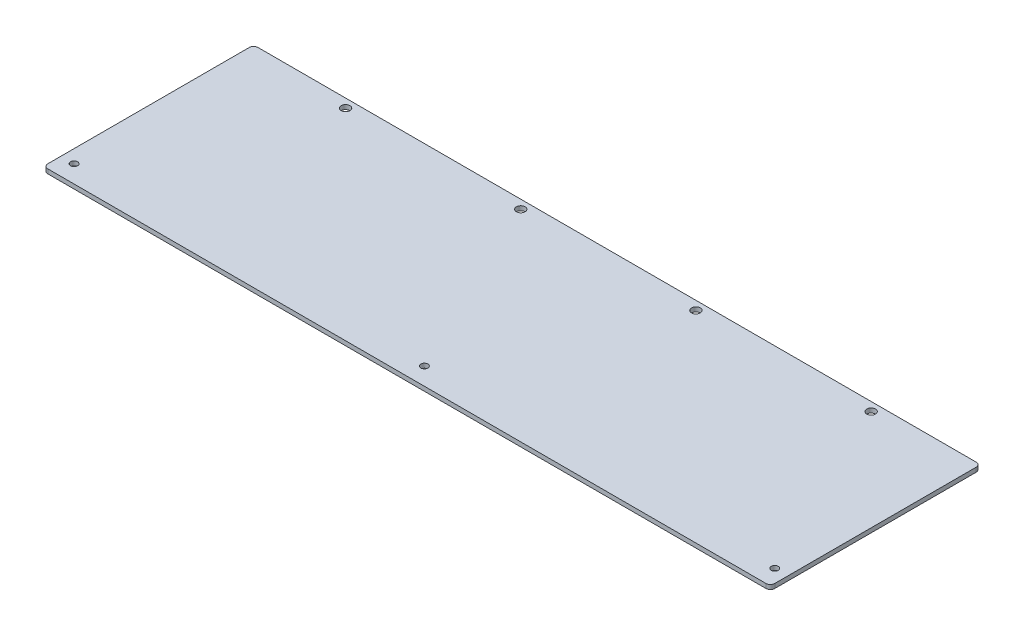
from build123d import *

# Parameters (mm, degrees)
SKETCH1_W                   = 527.05
SKETCH1_H                   = 152.4
BOSS_EXTRUDE1_DEPTH         = 3.175
F_7_0_201_DIAMETER_HOLE1_D  = 5.1054
FILLET1_R                   = 3.175
F_1_4_0_25_DIAMETER_HOLE1_D = 6.35


with BuildPart() as part:
    # Sketch1 → Boss-Extrude1 (new body)
    with BuildSketch(Plane(origin=(0, 0, 0), x_dir=(1, 0, 0), z_dir=(0, 1, 0))):
        Rectangle(SKETCH1_W, SKETCH1_H)
    extrude(amount=BOSS_EXTRUDE1_DEPTH)

    # 7 _0.201_ Diameter Hole1 (through all)
    with Locations(Plane(origin=(0, 0, 0), x_dir=(-1, 0, 0), z_dir=(0, -1, 0))):
        with Locations((-254, -63.5), (0, -63.5), (254, -63.5)):
            Hole(F_7_0_201_DIAMETER_HOLE1_D / 2)

    # Fillet1
    fillet1_edges = [part.edges().sort_by_distance(p)[0] for p in [
        (263.525, 1.5875, 76.2),
        (-263.525, 1.5875, 76.2),
        (-263.525, 1.5875, -76.2),
        (263.525, 1.5875, -76.2),
    ]]
    fillet(fillet1_edges, radius=FILLET1_R)

    # 1_4 _0.25_ Diameter Hole1 (through all)
    with Locations(Plane(origin=(0, 3.175, 0), x_dir=(1, 0, 0), z_dir=(0, 1, 0))):
        with Locations((190.5, 69.85), (63.5, 69.85), (-63.5, 69.85), (-190.5, 69.85)):
            Hole(F_1_4_0_25_DIAMETER_HOLE1_D / 2)


solid = part.part
